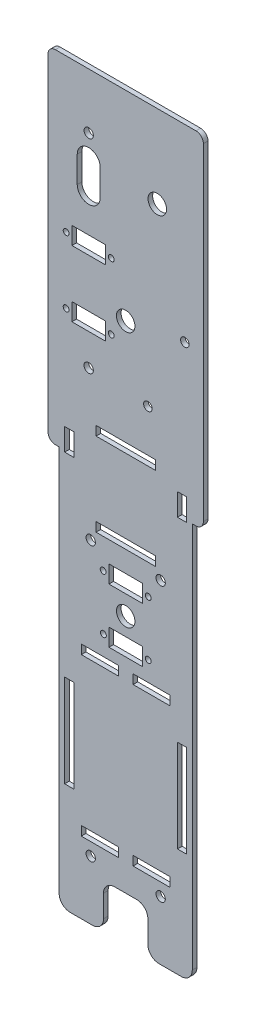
from build123d import *

# Parameters (mm, degrees)
SKETCH1_W                   = 53.34
SKETCH1_H                   = 254
BOSS_EXTRUDE1_DEPTH         = 1.5875
SKETCH2_W                   = 12.7
SKETCH2_H                   = 139.7
CUT_EXTRUDE1_DEPTH          = 130.779848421
SKETCH3_W                   = 15.24
SKETCH3_H                   = 38.1
CUT_EXTRUDE2_DEPTH          = 130.779848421
FILLET1_R                   = 3.81
FILLET2_R                   = 2.54
F_4_CLEARANCE_HOLE1_D       = 2.9464
M3_CLEARANCE_HOLE2_D        = 3.2
M3_CLEARANCE_HOLE3_D        = 3.2
SKETCH12_W                  = 3.175
SKETCH12_H                  = 31.75
SKETCH12_W_2                = 12.7
SKETCH12_H_2                = 3.175
CUT_EXTRUDE3_DEPTH          = 130.779848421
SKETCH13_W                  = 20.32
SKETCH13_H                  = 3.175
SKETCH13_W_2                = 3.175
SKETCH13_H_2                = 7.62
CUT_EXTRUDE4_DEPTH          = 130.779848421
CUT_EXTRUDE5_DEPTH          = 2.54
F_1_4_0_25_DIAMETER_HOLE1_D = 6.35
SKETCH19_R                  = 1.0033
SKETCH19_W                  = 11.5062
SKETCH19_H                  = 5.9944
CUT_EXTRUDE6_DEPTH          = 130.779848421


with BuildPart() as part:
    # Sketch1 → Boss-Extrude1 (new body)
    with BuildSketch(Plane.XY):
        Rectangle(SKETCH1_W, SKETCH1_H)
    extrude(amount=BOSS_EXTRUDE1_DEPTH)

    # Sketch2 → Cut-Extrude1 (cut, through all)
    with BuildSketch(Plane.XY.offset(1.5875)):
        with Locations((29.21, -60.325)):
            Rectangle(SKETCH2_W, SKETCH2_H)
        with Locations((-29.21, -60.325)):
            Rectangle(SKETCH2_W, SKETCH2_H)
    extrude(amount=-CUT_EXTRUDE1_DEPTH, mode=Mode.SUBTRACT)

    # Sketch3 → Cut-Extrude2 (cut, through all)
    with BuildSketch(Plane.XY.offset(1.5875)):
        with Locations((0, -130.81)):
            Rectangle(SKETCH3_W, SKETCH3_H)
    extrude(amount=-CUT_EXTRUDE2_DEPTH, mode=Mode.SUBTRACT)

    # Fillet1
    fillet1_edges = [part.edges().sort_by_distance(p)[0] for p in [
        (-22.86, -127, 0.79375),
        (22.86, -127, 0.79375),
        (7.62, -127, 0.79375),
        (7.62, -111.76, 0.79375),
        (-7.62, -127, 0.79375),
        (-7.62, -111.76, 0.79375),
    ]]
    fillet(fillet1_edges, radius=FILLET1_R)

    # Fillet2
    fillet2_edges = [part.edges().sort_by_distance(p)[0] for p in [
        (-26.67, 9.525, 0.79375),
        (26.67, 9.525, 0.79375),
        (-26.67, 127, 0.79375),
        (26.67, 127, 0.79375),
    ]]
    fillet(fillet2_edges, radius=FILLET2_R)

    # 4 Clearance Hole1 (through all)
    with Locations(Plane.XY.offset(1.5875)):
        with Locations((-39.44963137, 54.198002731), (20.32, 62.23), (7.62, 36.83)):
            Hole(F_4_CLEARANCE_HOLE1_D / 2)

    # M3 Clearance Hole2 (through all)
    with Locations(Plane.XY.offset(1.5875)):
        with Locations((-12, -12.735486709), (12, -12.735486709), (12, -106.735486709), (-12, -106.735486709)):
            Hole(M3_CLEARANCE_HOLE2_D / 2)

    # M3 Clearance Hole3 (through all)
    with Locations(Plane.XY.offset(1.5875)):
        with Locations((-12.7, 38.1), (-12.7, 107.95)):
            Hole(M3_CLEARANCE_HOLE3_D / 2)

    # Sketch12 → Cut-Extrude3 (cut, through all)
    with BuildSketch(Plane.XY.offset(1.5875)):
        with Locations((19.3675, -73.835889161)):
            Rectangle(SKETCH12_W, SKETCH12_H)
        with Locations((8.89, -46.848389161)):
            Rectangle(SKETCH12_W_2, SKETCH12_H_2)
        with Locations((8.89, -100.823389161)):
            Rectangle(SKETCH12_W_2, SKETCH12_H_2)
        with Locations((-8.89, -46.848389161)):
            Rectangle(SKETCH12_W_2, SKETCH12_H_2)
        with Locations((-8.89, -100.823389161)):
            Rectangle(SKETCH12_W_2, SKETCH12_H_2)
        with Locations((-19.3675, -73.835889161)):
            Rectangle(SKETCH12_W, SKETCH12_H)
    extrude(amount=-CUT_EXTRUDE3_DEPTH, mode=Mode.SUBTRACT)

    # Sketch13 → Cut-Extrude4 (cut, through all)
    with BuildSketch(Plane.XY.offset(1.5875)):
        with Locations((0, -7.906349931)):
            Rectangle(SKETCH13_W, SKETCH13_H)
        with Locations((0, 20.668650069)):
            Rectangle(SKETCH13_W, SKETCH13_H)
        with Locations((19.3675, 12.731150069)):
            Rectangle(SKETCH13_W_2, SKETCH13_H_2)
        with Locations((-19.3675, 12.731150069)):
            Rectangle(SKETCH13_W_2, SKETCH13_H_2)
    extrude(amount=-CUT_EXTRUDE4_DEPTH, mode=Mode.SUBTRACT)

    # Sketch15 → Cut-Extrude5 (cut)
    with BuildSketch(Plane.XY.offset(1.5875)):
        with BuildLine():
            Line((-8.763172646, 99.6777813), (-8.763172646, 90.65795785))
            ThreePointArc((-8.763172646, 90.65795785), (-12.7, 86.721130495), (-16.636827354, 90.65795785))
            Line((-16.636827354, 90.65795785), (-16.636827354, 99.6777813))
            ThreePointArc((-16.636827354, 99.6777813), (-12.7, 103.614608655), (-8.763172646, 99.6777813))
        make_face()
    extrude(amount=-CUT_EXTRUDE5_DEPTH, mode=Mode.SUBTRACT)

    # 1_4 _0.25_ Diameter Hole1 (through all)
    with Locations(Plane.XY.offset(1.5875)):
        with Locations((10.845990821, 98.586105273), (0, 58.403689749), (0, -29.384570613)):
            Hole(F_1_4_0_25_DIAMETER_HOLE1_D / 2)

    # Sketch19 → Cut-Extrude6 (cut, through all)
    with BuildSketch(Plane.XY.offset(1.5875)):
        with Locations((-4.953, 74.601645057)):
            Circle(SKETCH19_R)
        with Locations((-20.447, 74.601645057)):
            Circle(SKETCH19_R)
        with Locations((-4.953, 51.924553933)):
            Circle(SKETCH19_R)
        with Locations((-20.447, 51.924553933)):
            Circle(SKETCH19_R)
        with Locations((7.747, -19.716091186)):
            Circle(SKETCH19_R)
        with Locations((-7.747, -19.716091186)):
            Circle(SKETCH19_R)
        with Locations((7.747, -38.503247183)):
            Circle(SKETCH19_R)
        with Locations((-7.6454, -38.503247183)):
            Circle(SKETCH19_R)
        with Locations((-12.7, 51.924553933)):
            Rectangle(SKETCH19_W, SKETCH19_H)
        with Locations((-12.7, 74.601645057)):
            Rectangle(SKETCH19_W, SKETCH19_H)
        with Locations((0, -19.716091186)):
            Rectangle(SKETCH19_W, SKETCH19_H)
        with Locations((0, -38.503247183)):
            Rectangle(SKETCH19_W, SKETCH19_H)
    extrude(amount=-CUT_EXTRUDE6_DEPTH, mode=Mode.SUBTRACT)


solid = part.part
